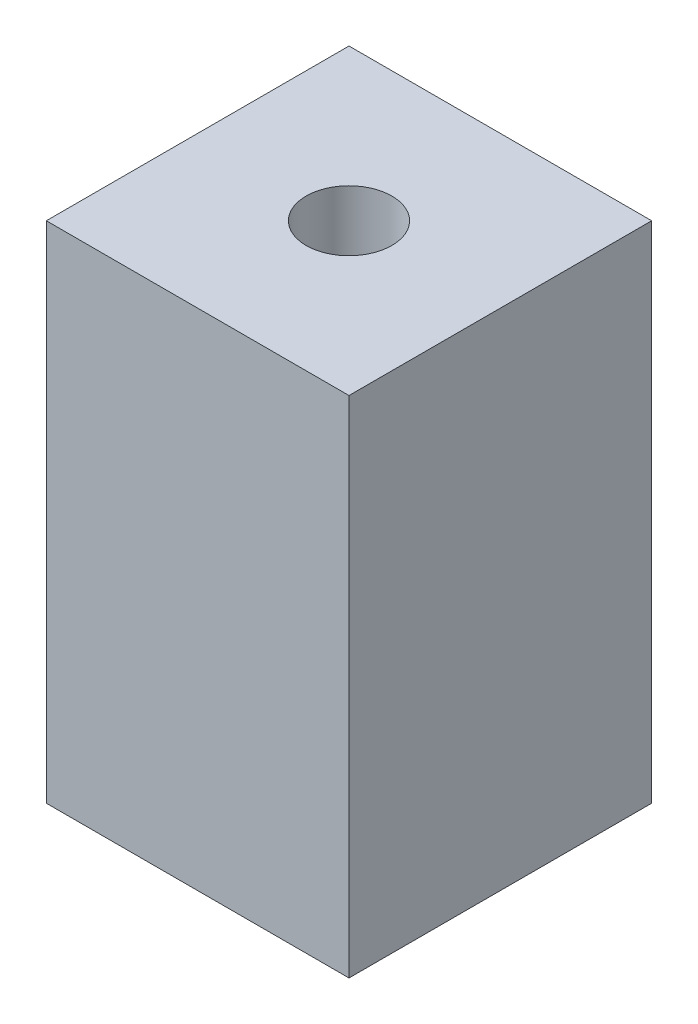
ISO-10303-21;
HEADER;
FILE_DESCRIPTION(('STEP AP214'),'2;1');
FILE_NAME('part.step','',(''),(''),'','','');
FILE_SCHEMA(('AUTOMOTIVE_DESIGN { 1 0 10303 214 1 1 1 1 }'));
ENDSEC;
DATA;
#1=APPLICATION_CONTEXT('core data for automotive mechanical design processes');
#2=APPLICATION_PROTOCOL_DEFINITION('international standard','automotive_design',2000,#1);
#3=PRODUCT_CONTEXT('',#1,'mechanical');
#4=PRODUCT('Part','Part','',(#3));
#5=PRODUCT_RELATED_PRODUCT_CATEGORY('part','',(#4));
#6=PRODUCT_DEFINITION_FORMATION('','',#4);
#7=PRODUCT_DEFINITION_CONTEXT('part definition',#1,'design');
#8=PRODUCT_DEFINITION('design','',#6,#7);
#9=PRODUCT_DEFINITION_SHAPE('','',#8);
#10=(LENGTH_UNIT() NAMED_UNIT(*) SI_UNIT(.MILLI.,.METRE.));
#11=(NAMED_UNIT(*) PLANE_ANGLE_UNIT() SI_UNIT($,.RADIAN.));
#12=(NAMED_UNIT(*) SI_UNIT($,.STERADIAN.) SOLID_ANGLE_UNIT());
#13=UNCERTAINTY_MEASURE_WITH_UNIT(LENGTH_MEASURE(1.E-05),#10,'distance_accuracy_value','');
#14=(GEOMETRIC_REPRESENTATION_CONTEXT(3) GLOBAL_UNCERTAINTY_ASSIGNED_CONTEXT((#13)) GLOBAL_UNIT_ASSIGNED_CONTEXT((#10,
#11,#12)) REPRESENTATION_CONTEXT('',''));
#15=CARTESIAN_POINT('',(0.,0.,0.));
#16=DIRECTION('',(0.,0.,1.));
#17=DIRECTION('',(1.,0.,0.));
#18=AXIS2_PLACEMENT_3D('',#15,#16,#17);
#19=CARTESIAN_POINT('',(15.,50.,-15.));
#20=DIRECTION('',(-1.,0.,0.));
#21=DIRECTION('',(0.,0.,1.));
#22=AXIS2_PLACEMENT_3D('',#19,#20,#21);
#23=PLANE('',#22);
#24=DIRECTION('',(0.,0.,-1.));
#25=VECTOR('',#24,1.);
#26=CARTESIAN_POINT('',(15.,0.,-15.));
#27=LINE('',#26,#25);
#28=CARTESIAN_POINT('',(15.,0.,15.));
#29=VERTEX_POINT('',#28);
#30=CARTESIAN_POINT('',(15.,0.,-15.));
#31=VERTEX_POINT('',#30);
#32=EDGE_CURVE('E96',#29,#31,#27,.T.);
#33=ORIENTED_EDGE('',*,*,#32,.T.);
#34=DIRECTION('',(0.,-1.,0.));
#35=VECTOR('',#34,1.);
#36=CARTESIAN_POINT('',(15.,50.,-15.));
#37=LINE('',#36,#35);
#38=CARTESIAN_POINT('',(15.,50.,-15.));
#39=VERTEX_POINT('',#38);
#40=EDGE_CURVE('E11',#39,#31,#37,.T.);
#41=ORIENTED_EDGE('',*,*,#40,.F.);
#42=DIRECTION('',(0.,0.,-1.));
#43=VECTOR('',#42,1.);
#44=CARTESIAN_POINT('',(15.,50.,-15.));
#45=LINE('',#44,#43);
#46=CARTESIAN_POINT('',(15.,50.,15.));
#47=VERTEX_POINT('',#46);
#48=EDGE_CURVE('E105',#47,#39,#45,.T.);
#49=ORIENTED_EDGE('',*,*,#48,.F.);
#50=DIRECTION('',(0.,-1.,0.));
#51=VECTOR('',#50,1.);
#52=CARTESIAN_POINT('',(15.,50.,15.));
#53=LINE('',#52,#51);
#54=EDGE_CURVE('E110',#47,#29,#53,.T.);
#55=ORIENTED_EDGE('',*,*,#54,.T.);
#56=EDGE_LOOP('',(#33,#41,#49,#55));
#57=FACE_BOUND('',#56,.T.);
#58=ADVANCED_FACE('F35',(#57),#23,.F.);
#59=CARTESIAN_POINT('',(-15.,50.,-15.));
#60=DIRECTION('',(0.,0.,1.));
#61=DIRECTION('',(1.,0.,0.));
#62=AXIS2_PLACEMENT_3D('',#59,#60,#61);
#63=PLANE('',#62);
#64=DIRECTION('',(-1.,0.,0.));
#65=VECTOR('',#64,1.);
#66=CARTESIAN_POINT('',(-15.,0.,-15.));
#67=LINE('',#66,#65);
#68=CARTESIAN_POINT('',(-15.,0.,-15.));
#69=VERTEX_POINT('',#68);
#70=EDGE_CURVE('E100',#31,#69,#67,.T.);
#71=ORIENTED_EDGE('',*,*,#70,.T.);
#72=DIRECTION('',(0.,-1.,0.));
#73=VECTOR('',#72,1.);
#74=CARTESIAN_POINT('',(-15.,50.,-15.));
#75=LINE('',#74,#73);
#76=CARTESIAN_POINT('',(-15.,50.,-15.));
#77=VERTEX_POINT('',#76);
#78=EDGE_CURVE('E43',#77,#69,#75,.T.);
#79=ORIENTED_EDGE('',*,*,#78,.F.);
#80=DIRECTION('',(-1.,0.,0.));
#81=VECTOR('',#80,1.);
#82=CARTESIAN_POINT('',(-15.,50.,-15.));
#83=LINE('',#82,#81);
#84=EDGE_CURVE('E82',#39,#77,#83,.T.);
#85=ORIENTED_EDGE('',*,*,#84,.F.);
#86=ORIENTED_EDGE('',*,*,#40,.T.);
#87=EDGE_LOOP('',(#71,#79,#85,#86));
#88=FACE_BOUND('',#87,.T.);
#89=ADVANCED_FACE('F134',(#88),#63,.F.);
#90=CARTESIAN_POINT('',(-15.,50.,-15.));
#91=DIRECTION('',(1.,0.,0.));
#92=DIRECTION('',(0.,0.,-1.));
#93=AXIS2_PLACEMENT_3D('',#90,#91,#92);
#94=PLANE('',#93);
#95=DIRECTION('',(0.,0.,1.));
#96=VECTOR('',#95,1.);
#97=CARTESIAN_POINT('',(-15.,0.,-15.));
#98=LINE('',#97,#96);
#99=CARTESIAN_POINT('',(-15.,0.,15.));
#100=VERTEX_POINT('',#99);
#101=EDGE_CURVE('E69',#69,#100,#98,.T.);
#102=ORIENTED_EDGE('',*,*,#101,.T.);
#103=DIRECTION('',(0.,-1.,0.));
#104=VECTOR('',#103,1.);
#105=CARTESIAN_POINT('',(-15.,50.,15.));
#106=LINE('',#105,#104);
#107=CARTESIAN_POINT('',(-15.,50.,15.));
#108=VERTEX_POINT('',#107);
#109=EDGE_CURVE('E116',#108,#100,#106,.T.);
#110=ORIENTED_EDGE('',*,*,#109,.F.);
#111=DIRECTION('',(0.,0.,1.));
#112=VECTOR('',#111,1.);
#113=CARTESIAN_POINT('',(-15.,50.,-15.));
#114=LINE('',#113,#112);
#115=EDGE_CURVE('E108',#77,#108,#114,.T.);
#116=ORIENTED_EDGE('',*,*,#115,.F.);
#117=ORIENTED_EDGE('',*,*,#78,.T.);
#118=EDGE_LOOP('',(#102,#110,#116,#117));
#119=FACE_BOUND('',#118,.T.);
#120=ADVANCED_FACE('F118',(#119),#94,.F.);
#121=CARTESIAN_POINT('',(-15.,50.,15.));
#122=DIRECTION('',(0.,0.,-1.));
#123=DIRECTION('',(-1.,0.,0.));
#124=AXIS2_PLACEMENT_3D('',#121,#122,#123);
#125=PLANE('',#124);
#126=DIRECTION('',(1.,0.,0.));
#127=VECTOR('',#126,1.);
#128=CARTESIAN_POINT('',(-15.,0.,15.));
#129=LINE('',#128,#127);
#130=EDGE_CURVE('E75',#100,#29,#129,.T.);
#131=ORIENTED_EDGE('',*,*,#130,.T.);
#132=ORIENTED_EDGE('',*,*,#54,.F.);
#133=DIRECTION('',(1.,0.,0.));
#134=VECTOR('',#133,1.);
#135=CARTESIAN_POINT('',(-15.,50.,15.));
#136=LINE('',#135,#134);
#137=EDGE_CURVE('E51',#108,#47,#136,.T.);
#138=ORIENTED_EDGE('',*,*,#137,.F.);
#139=ORIENTED_EDGE('',*,*,#109,.T.);
#140=EDGE_LOOP('',(#131,#132,#138,#139));
#141=FACE_BOUND('',#140,.T.);
#142=ADVANCED_FACE('F124',(#141),#125,.F.);
#143=CARTESIAN_POINT('',(0.,50.,0.));
#144=DIRECTION('',(0.,1.,0.));
#145=DIRECTION('',(0.,0.,1.));
#146=AXIS2_PLACEMENT_3D('',#143,#144,#145);
#147=PLANE('',#146);
#148=CARTESIAN_POINT('',(0.,50.,0.));
#149=DIRECTION('',(0.,1.,0.));
#150=DIRECTION('',(0.,0.,1.));
#151=AXIS2_PLACEMENT_3D('',#148,#149,#150);
#152=CIRCLE('',#151,4.24999999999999);
#153=CARTESIAN_POINT('',(0.,50.,4.24999999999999));
#154=VERTEX_POINT('',#153);
#155=EDGE_CURVE('E97',#154,#154,#152,.T.);
#156=ORIENTED_EDGE('',*,*,#155,.F.);
#157=EDGE_LOOP('',(#156));
#158=FACE_BOUND('',#157,.T.);
#159=ORIENTED_EDGE('',*,*,#48,.T.);
#160=ORIENTED_EDGE('',*,*,#84,.T.);
#161=ORIENTED_EDGE('',*,*,#115,.T.);
#162=ORIENTED_EDGE('',*,*,#137,.T.);
#163=EDGE_LOOP('',(#159,#160,#161,#162));
#164=FACE_BOUND('',#163,.T.);
#165=ADVANCED_FACE('F126',(#158,#164),#147,.T.);
#166=CARTESIAN_POINT('',(0.,0.,0.));
#167=DIRECTION('',(0.,1.,0.));
#168=DIRECTION('',(0.,0.,1.));
#169=AXIS2_PLACEMENT_3D('',#166,#167,#168);
#170=PLANE('',#169);
#171=ORIENTED_EDGE('',*,*,#32,.F.);
#172=ORIENTED_EDGE('',*,*,#130,.F.);
#173=ORIENTED_EDGE('',*,*,#101,.F.);
#174=ORIENTED_EDGE('',*,*,#70,.F.);
#175=EDGE_LOOP('',(#171,#172,#173,#174));
#176=FACE_BOUND('',#175,.T.);
#177=ADVANCED_FACE('F90',(#176),#170,.F.);
#178=CARTESIAN_POINT('',(0.,17.7,0.));
#179=DIRECTION('',(0.,1.,0.));
#180=DIRECTION('',(0.,0.,1.));
#181=AXIS2_PLACEMENT_3D('',#178,#179,#180);
#182=CONICAL_SURFACE('',#181,4.24999999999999,1.02974425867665);
#183=CARTESIAN_POINT('',(0.,15.1463423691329,0.));
#184=VERTEX_POINT('',#183);
#185=VERTEX_LOOP('',#184);
#186=FACE_BOUND('',#185,.T.);
#187=CARTESIAN_POINT('',(0.,17.7,0.));
#188=DIRECTION('',(0.,1.,0.));
#189=DIRECTION('',(0.,0.,1.));
#190=AXIS2_PLACEMENT_3D('',#187,#188,#189);
#191=CIRCLE('',#190,4.24999999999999);
#192=CARTESIAN_POINT('',(0.,17.7,4.24999999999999));
#193=VERTEX_POINT('',#192);
#194=EDGE_CURVE('E94',#193,#193,#191,.T.);
#195=ORIENTED_EDGE('',*,*,#194,.T.);
#196=EDGE_LOOP('',(#195));
#197=FACE_BOUND('',#196,.T.);
#198=ADVANCED_FACE('F86',(#186,#197),#182,.F.);
#199=CARTESIAN_POINT('',(0.,50.,0.));
#200=DIRECTION('',(0.,1.,0.));
#201=DIRECTION('',(0.,0.,1.));
#202=AXIS2_PLACEMENT_3D('',#199,#200,#201);
#203=CYLINDRICAL_SURFACE('',#202,4.24999999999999);
#204=ORIENTED_EDGE('',*,*,#194,.F.);
#205=EDGE_LOOP('',(#204));
#206=FACE_BOUND('',#205,.T.);
#207=ORIENTED_EDGE('',*,*,#155,.T.);
#208=EDGE_LOOP('',(#207));
#209=FACE_BOUND('',#208,.T.);
#210=ADVANCED_FACE('F89',(#206,#209),#203,.F.);
#211=CLOSED_SHELL('',(#58,#89,#120,#142,#165,#177,#198,#210));
#212=MANIFOLD_SOLID_BREP('B2',#211);
#213=ADVANCED_BREP_SHAPE_REPRESENTATION('',(#18,#212),#14);
#214=SHAPE_DEFINITION_REPRESENTATION(#9,#213);
ENDSEC;
END-ISO-10303-21;
